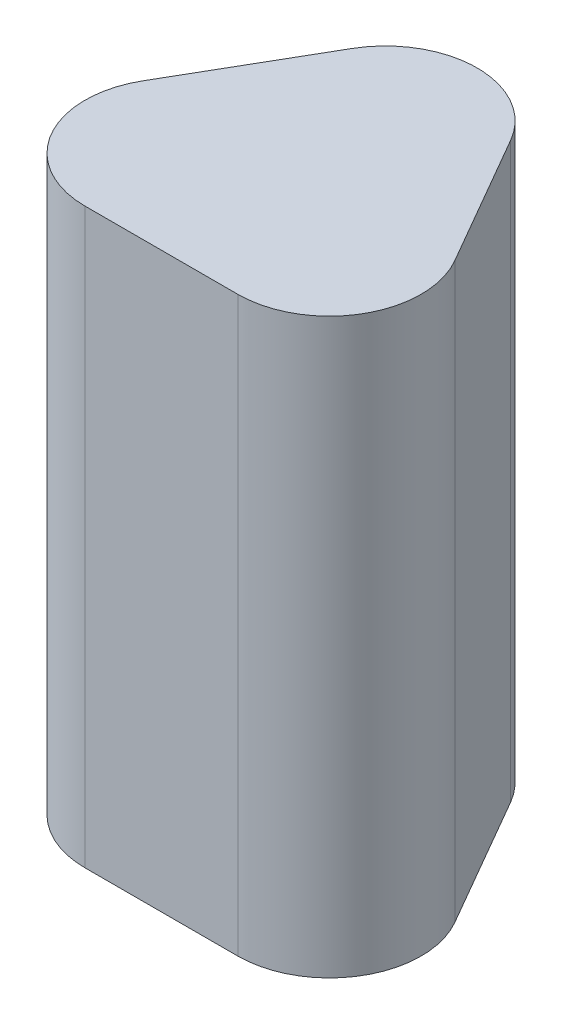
ISO-10303-21;
HEADER;
FILE_DESCRIPTION(('STEP AP214'),'2;1');
FILE_NAME('part.step','',(''),(''),'','','');
FILE_SCHEMA(('AUTOMOTIVE_DESIGN { 1 0 10303 214 1 1 1 1 }'));
ENDSEC;
DATA;
#1=APPLICATION_CONTEXT('core data for automotive mechanical design processes');
#2=APPLICATION_PROTOCOL_DEFINITION('international standard','automotive_design',2000,#1);
#3=PRODUCT_CONTEXT('',#1,'mechanical');
#4=PRODUCT('Part','Part','',(#3));
#5=PRODUCT_RELATED_PRODUCT_CATEGORY('part','',(#4));
#6=PRODUCT_DEFINITION_FORMATION('','',#4);
#7=PRODUCT_DEFINITION_CONTEXT('part definition',#1,'design');
#8=PRODUCT_DEFINITION('design','',#6,#7);
#9=PRODUCT_DEFINITION_SHAPE('','',#8);
#10=(LENGTH_UNIT() NAMED_UNIT(*) SI_UNIT(.MILLI.,.METRE.));
#11=(NAMED_UNIT(*) PLANE_ANGLE_UNIT() SI_UNIT($,.RADIAN.));
#12=(NAMED_UNIT(*) SI_UNIT($,.STERADIAN.) SOLID_ANGLE_UNIT());
#13=UNCERTAINTY_MEASURE_WITH_UNIT(LENGTH_MEASURE(1.E-05),#10,'distance_accuracy_value','');
#14=(GEOMETRIC_REPRESENTATION_CONTEXT(3) GLOBAL_UNCERTAINTY_ASSIGNED_CONTEXT((#13)) GLOBAL_UNIT_ASSIGNED_CONTEXT((#10,
#11,#12)) REPRESENTATION_CONTEXT('',''));
#15=CARTESIAN_POINT('',(0.,0.,0.));
#16=DIRECTION('',(0.,0.,1.));
#17=DIRECTION('',(1.,0.,0.));
#18=AXIS2_PLACEMENT_3D('',#15,#16,#17);
#19=CARTESIAN_POINT('',(0.,75.,-11.5470053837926));
#20=DIRECTION('',(0.,-1.,0.));
#21=DIRECTION('',(0.,0.,-1.));
#22=AXIS2_PLACEMENT_3D('',#19,#20,#21);
#23=CYLINDRICAL_SURFACE('',#22,12.);
#24=CARTESIAN_POINT('',(0.,0.,-11.5470053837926));
#25=DIRECTION('',(0.,1.,0.));
#26=DIRECTION('',(0.,0.,-1.));
#27=AXIS2_PLACEMENT_3D('',#24,#25,#26);
#28=CIRCLE('',#27,12.);
#29=CARTESIAN_POINT('',(10.3923048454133,0.,-17.5470053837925));
#30=VERTEX_POINT('',#29);
#31=CARTESIAN_POINT('',(-10.3923048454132,0.,-17.5470053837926));
#32=VERTEX_POINT('',#31);
#33=EDGE_CURVE('E257',#30,#32,#28,.T.);
#34=ORIENTED_EDGE('',*,*,#33,.T.);
#35=DIRECTION('',(0.,-1.,0.));
#36=VECTOR('',#35,1.);
#37=CARTESIAN_POINT('',(-10.3923048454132,75.,-17.5470053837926));
#38=LINE('',#37,#36);
#39=CARTESIAN_POINT('',(-10.3923048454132,75.,-17.5470053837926));
#40=VERTEX_POINT('',#39);
#41=EDGE_CURVE('E44',#40,#32,#38,.T.);
#42=ORIENTED_EDGE('',*,*,#41,.F.);
#43=CARTESIAN_POINT('',(0.,75.,-11.5470053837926));
#44=DIRECTION('',(0.,1.,0.));
#45=DIRECTION('',(0.,0.,-1.));
#46=AXIS2_PLACEMENT_3D('',#43,#44,#45);
#47=CIRCLE('',#46,12.);
#48=CARTESIAN_POINT('',(10.3923048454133,75.,-17.5470053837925));
#49=VERTEX_POINT('',#48);
#50=EDGE_CURVE('E258',#49,#40,#47,.T.);
#51=ORIENTED_EDGE('',*,*,#50,.F.);
#52=DIRECTION('',(0.,-1.,0.));
#53=VECTOR('',#52,1.);
#54=CARTESIAN_POINT('',(10.3923048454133,75.,-17.5470053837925));
#55=LINE('',#54,#53);
#56=EDGE_CURVE('E272',#49,#30,#55,.T.);
#57=ORIENTED_EDGE('',*,*,#56,.T.);
#58=EDGE_LOOP('',(#34,#42,#51,#57));
#59=FACE_BOUND('',#58,.T.);
#60=ADVANCED_FACE('F37',(#59),#23,.T.);
#61=CARTESIAN_POINT('',(-10.3923048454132,75.,-17.5470053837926));
#62=DIRECTION('',(0.866025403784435,0.,0.500000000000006));
#63=DIRECTION('',(0.500000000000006,0.,-0.866025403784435));
#64=AXIS2_PLACEMENT_3D('',#61,#62,#63);
#65=PLANE('',#64);
#66=DIRECTION('',(-0.500000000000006,0.,0.866025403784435));
#67=VECTOR('',#66,1.);
#68=CARTESIAN_POINT('',(-10.3923048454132,0.,-17.5470053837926));
#69=LINE('',#68,#67);
#70=CARTESIAN_POINT('',(-20.3923048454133,0.,-0.226497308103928));
#71=VERTEX_POINT('',#70);
#72=EDGE_CURVE('E275',#32,#71,#69,.T.);
#73=ORIENTED_EDGE('',*,*,#72,.T.);
#74=DIRECTION('',(0.,-1.,0.));
#75=VECTOR('',#74,1.);
#76=CARTESIAN_POINT('',(-20.3923048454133,75.,-0.226497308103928));
#77=LINE('',#76,#75);
#78=CARTESIAN_POINT('',(-20.3923048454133,75.,-0.226497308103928));
#79=VERTEX_POINT('',#78);
#80=EDGE_CURVE('E295',#79,#71,#77,.T.);
#81=ORIENTED_EDGE('',*,*,#80,.F.);
#82=DIRECTION('',(-0.500000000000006,0.,0.866025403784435));
#83=VECTOR('',#82,1.);
#84=CARTESIAN_POINT('',(-10.3923048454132,75.,-17.5470053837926));
#85=LINE('',#84,#83);
#86=EDGE_CURVE('E261',#40,#79,#85,.T.);
#87=ORIENTED_EDGE('',*,*,#86,.F.);
#88=ORIENTED_EDGE('',*,*,#41,.T.);
#89=EDGE_LOOP('',(#73,#81,#87,#88));
#90=FACE_BOUND('',#89,.T.);
#91=ADVANCED_FACE('F300',(#90),#65,.F.);
#92=CARTESIAN_POINT('',(-10.0000000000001,75.,5.77350269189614));
#93=DIRECTION('',(0.,-1.,0.));
#94=DIRECTION('',(0.,0.,-1.));
#95=AXIS2_PLACEMENT_3D('',#92,#93,#94);
#96=CYLINDRICAL_SURFACE('',#95,12.);
#97=CARTESIAN_POINT('',(-10.0000000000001,0.,5.77350269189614));
#98=DIRECTION('',(0.,1.,0.));
#99=DIRECTION('',(0.,0.,1.));
#100=AXIS2_PLACEMENT_3D('',#97,#98,#99);
#101=CIRCLE('',#100,12.);
#102=CARTESIAN_POINT('',(-10.0000000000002,0.,17.7735026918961));
#103=VERTEX_POINT('',#102);
#104=EDGE_CURVE('E277',#71,#103,#101,.T.);
#105=ORIENTED_EDGE('',*,*,#104,.T.);
#106=DIRECTION('',(0.,-1.,0.));
#107=VECTOR('',#106,1.);
#108=CARTESIAN_POINT('',(-10.0000000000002,75.,17.7735026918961));
#109=LINE('',#108,#107);
#110=CARTESIAN_POINT('',(-10.0000000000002,75.,17.7735026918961));
#111=VERTEX_POINT('',#110);
#112=EDGE_CURVE('E292',#111,#103,#109,.T.);
#113=ORIENTED_EDGE('',*,*,#112,.F.);
#114=CARTESIAN_POINT('',(-10.0000000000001,75.,5.77350269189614));
#115=DIRECTION('',(0.,1.,0.));
#116=DIRECTION('',(0.,0.,1.));
#117=AXIS2_PLACEMENT_3D('',#114,#115,#116);
#118=CIRCLE('',#117,12.);
#119=EDGE_CURVE('E264',#79,#111,#118,.T.);
#120=ORIENTED_EDGE('',*,*,#119,.F.);
#121=ORIENTED_EDGE('',*,*,#80,.T.);
#122=EDGE_LOOP('',(#105,#113,#120,#121));
#123=FACE_BOUND('',#122,.T.);
#124=ADVANCED_FACE('F314',(#123),#96,.T.);
#125=CARTESIAN_POINT('',(9.9999999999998,75.,17.7735026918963));
#126=DIRECTION('',(0.,0.,-1.));
#127=DIRECTION('',(-1.,0.,0.));
#128=AXIS2_PLACEMENT_3D('',#125,#126,#127);
#129=PLANE('',#128);
#130=DIRECTION('',(1.,0.,0.));
#131=VECTOR('',#130,1.);
#132=CARTESIAN_POINT('',(9.9999999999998,0.,17.7735026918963));
#133=LINE('',#132,#131);
#134=CARTESIAN_POINT('',(9.9999999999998,0.,17.7735026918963));
#135=VERTEX_POINT('',#134);
#136=EDGE_CURVE('E279',#103,#135,#133,.T.);
#137=ORIENTED_EDGE('',*,*,#136,.T.);
#138=DIRECTION('',(0.,-1.,0.));
#139=VECTOR('',#138,1.);
#140=CARTESIAN_POINT('',(9.9999999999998,75.,17.7735026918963));
#141=LINE('',#140,#139);
#142=CARTESIAN_POINT('',(9.9999999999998,75.,17.7735026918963));
#143=VERTEX_POINT('',#142);
#144=EDGE_CURVE('E289',#143,#135,#141,.T.);
#145=ORIENTED_EDGE('',*,*,#144,.F.);
#146=DIRECTION('',(1.,0.,0.));
#147=VECTOR('',#146,1.);
#148=CARTESIAN_POINT('',(9.9999999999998,75.,17.7735026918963));
#149=LINE('',#148,#147);
#150=EDGE_CURVE('E266',#111,#143,#149,.T.);
#151=ORIENTED_EDGE('',*,*,#150,.F.);
#152=ORIENTED_EDGE('',*,*,#112,.T.);
#153=EDGE_LOOP('',(#137,#145,#151,#152));
#154=FACE_BOUND('',#153,.T.);
#155=ADVANCED_FACE('F318',(#154),#129,.F.);
#156=CARTESIAN_POINT('',(9.99999999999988,75.,5.77350269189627));
#157=DIRECTION('',(0.,-1.,0.));
#158=DIRECTION('',(0.,0.,-1.));
#159=AXIS2_PLACEMENT_3D('',#156,#157,#158);
#160=CYLINDRICAL_SURFACE('',#159,12.);
#161=CARTESIAN_POINT('',(9.99999999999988,0.,5.77350269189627));
#162=DIRECTION('',(0.,1.,0.));
#163=DIRECTION('',(0.,0.,-1.));
#164=AXIS2_PLACEMENT_3D('',#161,#162,#163);
#165=CIRCLE('',#164,12.);
#166=CARTESIAN_POINT('',(20.3923048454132,0.,-0.226497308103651));
#167=VERTEX_POINT('',#166);
#168=EDGE_CURVE('E281',#135,#167,#165,.T.);
#169=ORIENTED_EDGE('',*,*,#168,.T.);
#170=DIRECTION('',(0.,-1.,0.));
#171=VECTOR('',#170,1.);
#172=CARTESIAN_POINT('',(20.3923048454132,75.,-0.226497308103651));
#173=LINE('',#172,#171);
#174=CARTESIAN_POINT('',(20.3923048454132,75.,-0.226497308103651));
#175=VERTEX_POINT('',#174);
#176=EDGE_CURVE('E286',#175,#167,#173,.T.);
#177=ORIENTED_EDGE('',*,*,#176,.F.);
#178=CARTESIAN_POINT('',(9.99999999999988,75.,5.77350269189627));
#179=DIRECTION('',(0.,1.,0.));
#180=DIRECTION('',(0.,0.,-1.));
#181=AXIS2_PLACEMENT_3D('',#178,#179,#180);
#182=CIRCLE('',#181,12.);
#183=EDGE_CURVE('E268',#143,#175,#182,.T.);
#184=ORIENTED_EDGE('',*,*,#183,.F.);
#185=ORIENTED_EDGE('',*,*,#144,.T.);
#186=EDGE_LOOP('',(#169,#177,#184,#185));
#187=FACE_BOUND('',#186,.T.);
#188=ADVANCED_FACE('F328',(#187),#160,.T.);
#189=CARTESIAN_POINT('',(10.3923048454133,75.,-17.5470053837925));
#190=DIRECTION('',(-0.866025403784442,0.,0.499999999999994));
#191=DIRECTION('',(0.499999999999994,0.,0.866025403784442));
#192=AXIS2_PLACEMENT_3D('',#189,#190,#191);
#193=PLANE('',#192);
#194=DIRECTION('',(-0.499999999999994,0.,-0.866025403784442));
#195=VECTOR('',#194,1.);
#196=CARTESIAN_POINT('',(10.3923048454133,0.,-17.5470053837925));
#197=LINE('',#196,#195);
#198=EDGE_CURVE('E262',#167,#30,#197,.T.);
#199=ORIENTED_EDGE('',*,*,#198,.T.);
#200=ORIENTED_EDGE('',*,*,#56,.F.);
#201=DIRECTION('',(-0.499999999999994,0.,-0.866025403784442));
#202=VECTOR('',#201,1.);
#203=CARTESIAN_POINT('',(10.3923048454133,75.,-17.5470053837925));
#204=LINE('',#203,#202);
#205=EDGE_CURVE('E270',#175,#49,#204,.T.);
#206=ORIENTED_EDGE('',*,*,#205,.F.);
#207=ORIENTED_EDGE('',*,*,#176,.T.);
#208=EDGE_LOOP('',(#199,#200,#206,#207));
#209=FACE_BOUND('',#208,.T.);
#210=ADVANCED_FACE('F326',(#209),#193,.F.);
#211=CARTESIAN_POINT('',(0.,75.,-11.5470053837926));
#212=DIRECTION('',(0.,-1.,0.));
#213=DIRECTION('',(0.,0.,-1.));
#214=AXIS2_PLACEMENT_3D('',#211,#212,#213);
#215=PLANE('',#214);
#216=ORIENTED_EDGE('',*,*,#50,.T.);
#217=ORIENTED_EDGE('',*,*,#86,.T.);
#218=ORIENTED_EDGE('',*,*,#119,.T.);
#219=ORIENTED_EDGE('',*,*,#150,.T.);
#220=ORIENTED_EDGE('',*,*,#183,.T.);
#221=ORIENTED_EDGE('',*,*,#205,.T.);
#222=EDGE_LOOP('',(#216,#217,#218,#219,#220,#221));
#223=FACE_BOUND('',#222,.T.);
#224=ADVANCED_FACE('F322',(#223),#215,.F.);
#225=CARTESIAN_POINT('',(0.,0.,-11.5470053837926));
#226=DIRECTION('',(0.,-1.,0.));
#227=DIRECTION('',(0.,0.,-1.));
#228=AXIS2_PLACEMENT_3D('',#225,#226,#227);
#229=PLANE('',#228);
#230=CARTESIAN_POINT('',(0.,0.,-11.5470053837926));
#231=DIRECTION('',(0.,-1.,0.));
#232=DIRECTION('',(0.,0.,-1.));
#233=AXIS2_PLACEMENT_3D('',#230,#231,#232);
#234=CIRCLE('',#233,10.75);
#235=CARTESIAN_POINT('',(-9.30977309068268,0.,-16.9220053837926));
#236=VERTEX_POINT('',#235);
#237=CARTESIAN_POINT('',(9.30977309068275,0.,-16.9220053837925));
#238=VERTEX_POINT('',#237);
#239=EDGE_CURVE('E51',#236,#238,#234,.T.);
#240=ORIENTED_EDGE('',*,*,#239,.F.);
#241=DIRECTION('',(0.500000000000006,0.,-0.866025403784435));
#242=VECTOR('',#241,1.);
#243=CARTESIAN_POINT('',(-19.3097730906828,0.,0.398502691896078));
#244=LINE('',#243,#242);
#245=CARTESIAN_POINT('',(-19.3097730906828,0.,0.398502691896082));
#246=VERTEX_POINT('',#245);
#247=EDGE_CURVE('E181',#246,#236,#244,.T.);
#248=ORIENTED_EDGE('',*,*,#247,.F.);
#249=CARTESIAN_POINT('',(-10.0000000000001,0.,5.77350269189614));
#250=DIRECTION('',(0.,-1.,0.));
#251=DIRECTION('',(0.,0.,-1.));
#252=AXIS2_PLACEMENT_3D('',#249,#250,#251);
#253=CIRCLE('',#252,10.75);
#254=CARTESIAN_POINT('',(-10.0000000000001,0.,16.5235026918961));
#255=VERTEX_POINT('',#254);
#256=EDGE_CURVE('E184',#255,#246,#253,.T.);
#257=ORIENTED_EDGE('',*,*,#256,.F.);
#258=DIRECTION('',(-1.,0.,0.));
#259=VECTOR('',#258,1.);
#260=CARTESIAN_POINT('',(9.99999999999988,0.,16.5235026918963));
#261=LINE('',#260,#259);
#262=CARTESIAN_POINT('',(9.99999999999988,0.,16.5235026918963));
#263=VERTEX_POINT('',#262);
#264=EDGE_CURVE('E204',#263,#255,#261,.T.);
#265=ORIENTED_EDGE('',*,*,#264,.F.);
#266=CARTESIAN_POINT('',(9.99999999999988,0.,5.77350269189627));
#267=DIRECTION('',(0.,-1.,0.));
#268=DIRECTION('',(0.,0.,-1.));
#269=AXIS2_PLACEMENT_3D('',#266,#267,#268);
#270=CIRCLE('',#269,10.75);
#271=CARTESIAN_POINT('',(19.3097730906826,0.,0.398502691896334));
#272=VERTEX_POINT('',#271);
#273=EDGE_CURVE('E201',#272,#263,#270,.T.);
#274=ORIENTED_EDGE('',*,*,#273,.F.);
#275=DIRECTION('',(0.499999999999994,0.,0.866025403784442));
#276=VECTOR('',#275,1.);
#277=CARTESIAN_POINT('',(9.30977309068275,0.,-16.9220053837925));
#278=LINE('',#277,#276);
#279=EDGE_CURVE('E198',#238,#272,#278,.T.);
#280=ORIENTED_EDGE('',*,*,#279,.F.);
#281=EDGE_LOOP('',(#240,#248,#257,#265,#274,#280));
#282=FACE_BOUND('',#281,.T.);
#283=ORIENTED_EDGE('',*,*,#33,.F.);
#284=ORIENTED_EDGE('',*,*,#198,.F.);
#285=ORIENTED_EDGE('',*,*,#168,.F.);
#286=ORIENTED_EDGE('',*,*,#136,.F.);
#287=ORIENTED_EDGE('',*,*,#104,.F.);
#288=ORIENTED_EDGE('',*,*,#72,.F.);
#289=EDGE_LOOP('',(#283,#284,#285,#286,#287,#288));
#290=FACE_BOUND('',#289,.T.);
#291=ADVANCED_FACE('F308',(#282,#290),#229,.T.);
#292=CARTESIAN_POINT('',(0.,2.5,-11.5470053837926));
#293=DIRECTION('',(0.,-1.,0.));
#294=DIRECTION('',(0.,0.,-1.));
#295=AXIS2_PLACEMENT_3D('',#292,#293,#294);
#296=PLANE('',#295);
#297=CARTESIAN_POINT('',(0.,2.5,-11.5470053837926));
#298=DIRECTION('',(0.,-1.,0.));
#299=DIRECTION('',(0.,0.,-1.));
#300=AXIS2_PLACEMENT_3D('',#297,#298,#299);
#301=CIRCLE('',#300,10.75);
#302=CARTESIAN_POINT('',(-9.30977309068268,2.5,-16.9220053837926));
#303=VERTEX_POINT('',#302);
#304=CARTESIAN_POINT('',(9.30977309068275,2.5,-16.9220053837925));
#305=VERTEX_POINT('',#304);
#306=EDGE_CURVE('E162',#303,#305,#301,.T.);
#307=ORIENTED_EDGE('',*,*,#306,.T.);
#308=DIRECTION('',(0.499999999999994,0.,0.866025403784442));
#309=VECTOR('',#308,1.);
#310=CARTESIAN_POINT('',(9.30977309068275,2.5,-16.9220053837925));
#311=LINE('',#310,#309);
#312=CARTESIAN_POINT('',(19.3097730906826,2.5,0.398502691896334));
#313=VERTEX_POINT('',#312);
#314=EDGE_CURVE('E171',#305,#313,#311,.T.);
#315=ORIENTED_EDGE('',*,*,#314,.T.);
#316=CARTESIAN_POINT('',(9.99999999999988,2.5,5.77350269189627));
#317=DIRECTION('',(0.,-1.,0.));
#318=DIRECTION('',(0.,0.,-1.));
#319=AXIS2_PLACEMENT_3D('',#316,#317,#318);
#320=CIRCLE('',#319,10.75);
#321=CARTESIAN_POINT('',(9.99999999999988,2.5,16.5235026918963));
#322=VERTEX_POINT('',#321);
#323=EDGE_CURVE('E176',#313,#322,#320,.T.);
#324=ORIENTED_EDGE('',*,*,#323,.T.);
#325=DIRECTION('',(-1.,0.,0.));
#326=VECTOR('',#325,1.);
#327=CARTESIAN_POINT('',(9.99999999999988,2.5,16.5235026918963));
#328=LINE('',#327,#326);
#329=CARTESIAN_POINT('',(-10.0000000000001,2.5,16.5235026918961));
#330=VERTEX_POINT('',#329);
#331=EDGE_CURVE('E191',#322,#330,#328,.T.);
#332=ORIENTED_EDGE('',*,*,#331,.T.);
#333=CARTESIAN_POINT('',(-10.0000000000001,2.5,5.77350269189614));
#334=DIRECTION('',(0.,-1.,0.));
#335=DIRECTION('',(0.,0.,-1.));
#336=AXIS2_PLACEMENT_3D('',#333,#334,#335);
#337=CIRCLE('',#336,10.75);
#338=CARTESIAN_POINT('',(-19.3097730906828,2.5,0.398502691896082));
#339=VERTEX_POINT('',#338);
#340=EDGE_CURVE('E194',#330,#339,#337,.T.);
#341=ORIENTED_EDGE('',*,*,#340,.T.);
#342=DIRECTION('',(0.500000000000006,0.,-0.866025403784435));
#343=VECTOR('',#342,1.);
#344=CARTESIAN_POINT('',(-19.3097730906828,2.5,0.398502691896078));
#345=LINE('',#344,#343);
#346=EDGE_CURVE('E168',#339,#303,#345,.T.);
#347=ORIENTED_EDGE('',*,*,#346,.T.);
#348=EDGE_LOOP('',(#307,#315,#324,#332,#341,#347));
#349=FACE_BOUND('',#348,.T.);
#350=CARTESIAN_POINT('',(-10.0000000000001,2.5,5.77350269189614));
#351=DIRECTION('',(0.,-1.,0.));
#352=DIRECTION('',(0.,0.,-1.));
#353=AXIS2_PLACEMENT_3D('',#350,#351,#352);
#354=CIRCLE('',#353,9.5);
#355=CARTESIAN_POINT('',(-18.2272413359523,2.5,1.02350269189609));
#356=VERTEX_POINT('',#355);
#357=CARTESIAN_POINT('',(-10.0000000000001,2.5,15.2735026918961));
#358=VERTEX_POINT('',#357);
#359=EDGE_CURVE('E225',#356,#358,#354,.F.);
#360=ORIENTED_EDGE('',*,*,#359,.T.);
#361=DIRECTION('',(1.,0.,0.));
#362=VECTOR('',#361,1.);
#363=CARTESIAN_POINT('',(-10.0000000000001,2.5,15.2735026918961));
#364=LINE('',#363,#362);
#365=CARTESIAN_POINT('',(9.99999999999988,2.5,15.2735026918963));
#366=VERTEX_POINT('',#365);
#367=EDGE_CURVE('E223',#358,#366,#364,.T.);
#368=ORIENTED_EDGE('',*,*,#367,.T.);
#369=CARTESIAN_POINT('',(9.99999999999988,2.5,5.77350269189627));
#370=DIRECTION('',(0.,-1.,0.));
#371=DIRECTION('',(0.,0.,-1.));
#372=AXIS2_PLACEMENT_3D('',#369,#370,#371);
#373=CIRCLE('',#372,9.5);
#374=CARTESIAN_POINT('',(18.2272413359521,2.5,1.02350269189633));
#375=VERTEX_POINT('',#374);
#376=EDGE_CURVE('E221',#366,#375,#373,.F.);
#377=ORIENTED_EDGE('',*,*,#376,.T.);
#378=DIRECTION('',(-0.499999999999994,0.,-0.866025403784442));
#379=VECTOR('',#378,1.);
#380=CARTESIAN_POINT('',(18.2272413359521,2.5,1.02350269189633));
#381=LINE('',#380,#379);
#382=CARTESIAN_POINT('',(8.2272413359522,2.5,-16.2970053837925));
#383=VERTEX_POINT('',#382);
#384=EDGE_CURVE('E219',#375,#383,#381,.T.);
#385=ORIENTED_EDGE('',*,*,#384,.T.);
#386=CARTESIAN_POINT('',(0.,2.5,-11.5470053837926));
#387=DIRECTION('',(0.,-1.,0.));
#388=DIRECTION('',(0.,0.,-1.));
#389=AXIS2_PLACEMENT_3D('',#386,#387,#388);
#390=CIRCLE('',#389,9.5);
#391=CARTESIAN_POINT('',(-8.22724133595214,2.5,-16.2970053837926));
#392=VERTEX_POINT('',#391);
#393=EDGE_CURVE('E58',#383,#392,#390,.F.);
#394=ORIENTED_EDGE('',*,*,#393,.T.);
#395=DIRECTION('',(-0.500000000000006,0.,0.866025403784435));
#396=VECTOR('',#395,1.);
#397=CARTESIAN_POINT('',(-18.2272413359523,2.5,1.02350269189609));
#398=LINE('',#397,#396);
#399=EDGE_CURVE('E12',#392,#356,#398,.T.);
#400=ORIENTED_EDGE('',*,*,#399,.T.);
#401=EDGE_LOOP('',(#360,#368,#377,#385,#394,#400));
#402=FACE_BOUND('',#401,.T.);
#403=ADVANCED_FACE('F178',(#349,#402),#296,.T.);
#404=CARTESIAN_POINT('',(0.,2.5,-11.5470053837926));
#405=DIRECTION('',(0.,-1.,0.));
#406=DIRECTION('',(0.,0.,-1.));
#407=AXIS2_PLACEMENT_3D('',#404,#405,#406);
#408=CYLINDRICAL_SURFACE('',#407,10.75);
#409=ORIENTED_EDGE('',*,*,#239,.T.);
#410=DIRECTION('',(0.,-1.,0.));
#411=VECTOR('',#410,1.);
#412=CARTESIAN_POINT('',(9.30977309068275,2.5,-16.9220053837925));
#413=LINE('',#412,#411);
#414=EDGE_CURVE('E158',#305,#238,#413,.T.);
#415=ORIENTED_EDGE('',*,*,#414,.F.);
#416=ORIENTED_EDGE('',*,*,#306,.F.);
#417=DIRECTION('',(0.,-1.,0.));
#418=VECTOR('',#417,1.);
#419=CARTESIAN_POINT('',(-9.30977309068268,2.5,-16.9220053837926));
#420=LINE('',#419,#418);
#421=EDGE_CURVE('E209',#303,#236,#420,.T.);
#422=ORIENTED_EDGE('',*,*,#421,.T.);
#423=EDGE_LOOP('',(#409,#415,#416,#422));
#424=FACE_BOUND('',#423,.T.);
#425=ADVANCED_FACE('F160',(#424),#408,.F.);
#426=CARTESIAN_POINT('',(-19.3097730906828,2.5,0.398502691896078));
#427=DIRECTION('',(-0.866025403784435,0.,-0.500000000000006));
#428=DIRECTION('',(-0.500000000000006,0.,0.866025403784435));
#429=AXIS2_PLACEMENT_3D('',#426,#427,#428);
#430=PLANE('',#429);
#431=ORIENTED_EDGE('',*,*,#247,.T.);
#432=ORIENTED_EDGE('',*,*,#421,.F.);
#433=ORIENTED_EDGE('',*,*,#346,.F.);
#434=DIRECTION('',(0.,-1.,0.));
#435=VECTOR('',#434,1.);
#436=CARTESIAN_POINT('',(-19.3097730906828,2.5,0.398502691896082));
#437=LINE('',#436,#435);
#438=EDGE_CURVE('E211',#339,#246,#437,.T.);
#439=ORIENTED_EDGE('',*,*,#438,.T.);
#440=EDGE_LOOP('',(#431,#432,#433,#439));
#441=FACE_BOUND('',#440,.T.);
#442=ADVANCED_FACE('F397',(#441),#430,.F.);
#443=CARTESIAN_POINT('',(-10.0000000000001,2.5,5.77350269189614));
#444=DIRECTION('',(0.,-1.,0.));
#445=DIRECTION('',(0.,0.,-1.));
#446=AXIS2_PLACEMENT_3D('',#443,#444,#445);
#447=CYLINDRICAL_SURFACE('',#446,10.75);
#448=ORIENTED_EDGE('',*,*,#256,.T.);
#449=ORIENTED_EDGE('',*,*,#438,.F.);
#450=ORIENTED_EDGE('',*,*,#340,.F.);
#451=DIRECTION('',(0.,-1.,0.));
#452=VECTOR('',#451,1.);
#453=CARTESIAN_POINT('',(-10.0000000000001,2.5,16.5235026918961));
#454=LINE('',#453,#452);
#455=EDGE_CURVE('E213',#330,#255,#454,.T.);
#456=ORIENTED_EDGE('',*,*,#455,.T.);
#457=EDGE_LOOP('',(#448,#449,#450,#456));
#458=FACE_BOUND('',#457,.T.);
#459=ADVANCED_FACE('F406',(#458),#447,.F.);
#460=CARTESIAN_POINT('',(9.99999999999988,2.5,16.5235026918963));
#461=DIRECTION('',(0.,0.,1.));
#462=DIRECTION('',(1.,0.,0.));
#463=AXIS2_PLACEMENT_3D('',#460,#461,#462);
#464=PLANE('',#463);
#465=ORIENTED_EDGE('',*,*,#264,.T.);
#466=ORIENTED_EDGE('',*,*,#455,.F.);
#467=ORIENTED_EDGE('',*,*,#331,.F.);
#468=DIRECTION('',(0.,-1.,0.));
#469=VECTOR('',#468,1.);
#470=CARTESIAN_POINT('',(9.99999999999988,2.5,16.5235026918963));
#471=LINE('',#470,#469);
#472=EDGE_CURVE('E215',#322,#263,#471,.T.);
#473=ORIENTED_EDGE('',*,*,#472,.T.);
#474=EDGE_LOOP('',(#465,#466,#467,#473));
#475=FACE_BOUND('',#474,.T.);
#476=ADVANCED_FACE('F416',(#475),#464,.F.);
#477=CARTESIAN_POINT('',(9.99999999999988,2.5,5.77350269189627));
#478=DIRECTION('',(0.,-1.,0.));
#479=DIRECTION('',(0.,0.,-1.));
#480=AXIS2_PLACEMENT_3D('',#477,#478,#479);
#481=CYLINDRICAL_SURFACE('',#480,10.75);
#482=ORIENTED_EDGE('',*,*,#273,.T.);
#483=ORIENTED_EDGE('',*,*,#472,.F.);
#484=ORIENTED_EDGE('',*,*,#323,.F.);
#485=DIRECTION('',(0.,-1.,0.));
#486=VECTOR('',#485,1.);
#487=CARTESIAN_POINT('',(19.3097730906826,2.5,0.398502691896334));
#488=LINE('',#487,#486);
#489=EDGE_CURVE('E167',#313,#272,#488,.T.);
#490=ORIENTED_EDGE('',*,*,#489,.T.);
#491=EDGE_LOOP('',(#482,#483,#484,#490));
#492=FACE_BOUND('',#491,.T.);
#493=ADVANCED_FACE('F426',(#492),#481,.F.);
#494=CARTESIAN_POINT('',(9.30977309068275,2.5,-16.9220053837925));
#495=DIRECTION('',(0.866025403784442,0.,-0.499999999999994));
#496=DIRECTION('',(-0.499999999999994,0.,-0.866025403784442));
#497=AXIS2_PLACEMENT_3D('',#494,#495,#496);
#498=PLANE('',#497);
#499=ORIENTED_EDGE('',*,*,#279,.T.);
#500=ORIENTED_EDGE('',*,*,#489,.F.);
#501=ORIENTED_EDGE('',*,*,#314,.F.);
#502=ORIENTED_EDGE('',*,*,#414,.T.);
#503=EDGE_LOOP('',(#499,#500,#501,#502));
#504=FACE_BOUND('',#503,.T.);
#505=ADVANCED_FACE('F172',(#504),#498,.F.);
#506=CARTESIAN_POINT('',(0.,72.,-11.5470053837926));
#507=DIRECTION('',(0.,-1.,0.));
#508=DIRECTION('',(0.,0.,-1.));
#509=AXIS2_PLACEMENT_3D('',#506,#507,#508);
#510=PLANE('',#509);
#511=CARTESIAN_POINT('',(10.3923048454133,72.,-5.99999999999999));
#512=DIRECTION('',(0.,-1.,0.));
#513=DIRECTION('',(0.,0.,-1.));
#514=AXIS2_PLACEMENT_3D('',#511,#512,#513);
#515=CIRCLE('',#514,2.6);
#516=CARTESIAN_POINT('',(10.3923048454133,72.,-8.59999999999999));
#517=VERTEX_POINT('',#516);
#518=EDGE_CURVE('E582',#517,#517,#515,.T.);
#519=ORIENTED_EDGE('',*,*,#518,.F.);
#520=EDGE_LOOP('',(#519));
#521=FACE_BOUND('',#520,.T.);
#522=CARTESIAN_POINT('',(-10.3923048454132,72.,-6.00000000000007));
#523=DIRECTION('',(0.,-1.,0.));
#524=DIRECTION('',(0.,0.,-1.));
#525=AXIS2_PLACEMENT_3D('',#522,#523,#524);
#526=CIRCLE('',#525,2.6);
#527=CARTESIAN_POINT('',(-10.3923048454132,72.,-8.60000000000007));
#528=VERTEX_POINT('',#527);
#529=EDGE_CURVE('E581',#528,#528,#526,.T.);
#530=ORIENTED_EDGE('',*,*,#529,.F.);
#531=EDGE_LOOP('',(#530));
#532=FACE_BOUND('',#531,.T.);
#533=CARTESIAN_POINT('',(0.,72.,12.));
#534=DIRECTION('',(0.,-1.,0.));
#535=DIRECTION('',(0.,0.,-1.));
#536=AXIS2_PLACEMENT_3D('',#533,#534,#535);
#537=CIRCLE('',#536,2.6);
#538=CARTESIAN_POINT('',(0.,72.,9.4));
#539=VERTEX_POINT('',#538);
#540=EDGE_CURVE('E187',#539,#539,#537,.T.);
#541=ORIENTED_EDGE('',*,*,#540,.F.);
#542=EDGE_LOOP('',(#541));
#543=FACE_BOUND('',#542,.T.);
#544=CARTESIAN_POINT('',(-10.0000000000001,72.,5.77350269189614));
#545=DIRECTION('',(0.,-1.,0.));
#546=DIRECTION('',(0.,0.,-1.));
#547=AXIS2_PLACEMENT_3D('',#544,#545,#546);
#548=CIRCLE('',#547,9.5);
#549=CARTESIAN_POINT('',(-18.2272413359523,72.,1.02350269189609));
#550=VERTEX_POINT('',#549);
#551=CARTESIAN_POINT('',(-10.0000000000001,72.,15.2735026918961));
#552=VERTEX_POINT('',#551);
#553=EDGE_CURVE('E237',#550,#552,#548,.F.);
#554=ORIENTED_EDGE('',*,*,#553,.F.);
#555=DIRECTION('',(-0.500000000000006,0.,0.866025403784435));
#556=VECTOR('',#555,1.);
#557=CARTESIAN_POINT('',(-18.2272413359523,72.,1.02350269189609));
#558=LINE('',#557,#556);
#559=CARTESIAN_POINT('',(-8.22724133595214,72.,-16.2970053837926));
#560=VERTEX_POINT('',#559);
#561=EDGE_CURVE('E239',#560,#550,#558,.T.);
#562=ORIENTED_EDGE('',*,*,#561,.F.);
#563=CARTESIAN_POINT('',(0.,72.,-11.5470053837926));
#564=DIRECTION('',(0.,-1.,0.));
#565=DIRECTION('',(0.,0.,-1.));
#566=AXIS2_PLACEMENT_3D('',#563,#564,#565);
#567=CIRCLE('',#566,9.5);
#568=CARTESIAN_POINT('',(8.2272413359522,72.,-16.2970053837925));
#569=VERTEX_POINT('',#568);
#570=EDGE_CURVE('E228',#569,#560,#567,.F.);
#571=ORIENTED_EDGE('',*,*,#570,.F.);
#572=DIRECTION('',(-0.499999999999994,0.,-0.866025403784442));
#573=VECTOR('',#572,1.);
#574=CARTESIAN_POINT('',(18.2272413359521,72.,1.02350269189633));
#575=LINE('',#574,#573);
#576=CARTESIAN_POINT('',(18.2272413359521,72.,1.02350269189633));
#577=VERTEX_POINT('',#576);
#578=EDGE_CURVE('E230',#577,#569,#575,.T.);
#579=ORIENTED_EDGE('',*,*,#578,.F.);
#580=CARTESIAN_POINT('',(9.99999999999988,72.,5.77350269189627));
#581=DIRECTION('',(0.,-1.,0.));
#582=DIRECTION('',(0.,0.,-1.));
#583=AXIS2_PLACEMENT_3D('',#580,#581,#582);
#584=CIRCLE('',#583,9.5);
#585=CARTESIAN_POINT('',(9.99999999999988,72.,15.2735026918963));
#586=VERTEX_POINT('',#585);
#587=EDGE_CURVE('E233',#586,#577,#584,.F.);
#588=ORIENTED_EDGE('',*,*,#587,.F.);
#589=DIRECTION('',(1.,0.,0.));
#590=VECTOR('',#589,1.);
#591=CARTESIAN_POINT('',(-10.0000000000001,72.,15.2735026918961));
#592=LINE('',#591,#590);
#593=EDGE_CURVE('E235',#552,#586,#592,.T.);
#594=ORIENTED_EDGE('',*,*,#593,.F.);
#595=EDGE_LOOP('',(#554,#562,#571,#579,#588,#594));
#596=FACE_BOUND('',#595,.T.);
#597=ADVANCED_FACE('F445',(#521,#532,#543,#596),#510,.T.);
#598=CARTESIAN_POINT('',(-18.2272413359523,128.293332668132,1.02350269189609));
#599=DIRECTION('',(-0.866025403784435,0.,-0.500000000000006));
#600=DIRECTION('',(-0.500000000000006,0.,0.866025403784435));
#601=AXIS2_PLACEMENT_3D('',#598,#599,#600);
#602=PLANE('',#601);
#603=ORIENTED_EDGE('',*,*,#399,.F.);
#604=DIRECTION('',(0.,-1.,0.));
#605=VECTOR('',#604,1.);
#606=CARTESIAN_POINT('',(-8.22724133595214,128.293332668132,-16.2970053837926));
#607=LINE('',#606,#605);
#608=EDGE_CURVE('E251',#560,#392,#607,.T.);
#609=ORIENTED_EDGE('',*,*,#608,.F.);
#610=ORIENTED_EDGE('',*,*,#561,.T.);
#611=DIRECTION('',(0.,-1.,0.));
#612=VECTOR('',#611,1.);
#613=CARTESIAN_POINT('',(-18.2272413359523,128.293332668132,1.02350269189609));
#614=LINE('',#613,#612);
#615=EDGE_CURVE('E227',#550,#356,#614,.T.);
#616=ORIENTED_EDGE('',*,*,#615,.T.);
#617=EDGE_LOOP('',(#603,#609,#610,#616));
#618=FACE_BOUND('',#617,.T.);
#619=ADVANCED_FACE('F452',(#618),#602,.F.);
#620=CARTESIAN_POINT('',(0.,128.293332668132,-11.5470053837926));
#621=DIRECTION('',(0.,-1.,0.));
#622=DIRECTION('',(0.,0.,-1.));
#623=AXIS2_PLACEMENT_3D('',#620,#621,#622);
#624=CYLINDRICAL_SURFACE('',#623,9.5);
#625=ORIENTED_EDGE('',*,*,#393,.F.);
#626=DIRECTION('',(0.,-1.,0.));
#627=VECTOR('',#626,1.);
#628=CARTESIAN_POINT('',(8.2272413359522,128.293332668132,-16.2970053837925));
#629=LINE('',#628,#627);
#630=EDGE_CURVE('E248',#569,#383,#629,.T.);
#631=ORIENTED_EDGE('',*,*,#630,.F.);
#632=ORIENTED_EDGE('',*,*,#570,.T.);
#633=ORIENTED_EDGE('',*,*,#608,.T.);
#634=EDGE_LOOP('',(#625,#631,#632,#633));
#635=FACE_BOUND('',#634,.T.);
#636=ADVANCED_FACE('F457',(#635),#624,.F.);
#637=CARTESIAN_POINT('',(18.2272413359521,128.293332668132,1.02350269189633));
#638=DIRECTION('',(0.866025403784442,0.,-0.499999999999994));
#639=DIRECTION('',(-0.499999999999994,0.,-0.866025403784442));
#640=AXIS2_PLACEMENT_3D('',#637,#638,#639);
#641=PLANE('',#640);
#642=ORIENTED_EDGE('',*,*,#384,.F.);
#643=DIRECTION('',(0.,-1.,0.));
#644=VECTOR('',#643,1.);
#645=CARTESIAN_POINT('',(18.2272413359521,128.293332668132,1.02350269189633));
#646=LINE('',#645,#644);
#647=EDGE_CURVE('E245',#577,#375,#646,.T.);
#648=ORIENTED_EDGE('',*,*,#647,.F.);
#649=ORIENTED_EDGE('',*,*,#578,.T.);
#650=ORIENTED_EDGE('',*,*,#630,.T.);
#651=EDGE_LOOP('',(#642,#648,#649,#650));
#652=FACE_BOUND('',#651,.T.);
#653=ADVANCED_FACE('F468',(#652),#641,.F.);
#654=CARTESIAN_POINT('',(9.99999999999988,128.293332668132,5.77350269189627));
#655=DIRECTION('',(0.,-1.,0.));
#656=DIRECTION('',(0.,0.,-1.));
#657=AXIS2_PLACEMENT_3D('',#654,#655,#656);
#658=CYLINDRICAL_SURFACE('',#657,9.5);
#659=ORIENTED_EDGE('',*,*,#376,.F.);
#660=DIRECTION('',(0.,-1.,0.));
#661=VECTOR('',#660,1.);
#662=CARTESIAN_POINT('',(9.99999999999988,128.293332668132,15.2735026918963));
#663=LINE('',#662,#661);
#664=EDGE_CURVE('E242',#586,#366,#663,.T.);
#665=ORIENTED_EDGE('',*,*,#664,.F.);
#666=ORIENTED_EDGE('',*,*,#587,.T.);
#667=ORIENTED_EDGE('',*,*,#647,.T.);
#668=EDGE_LOOP('',(#659,#665,#666,#667));
#669=FACE_BOUND('',#668,.T.);
#670=ADVANCED_FACE('F478',(#669),#658,.F.);
#671=CARTESIAN_POINT('',(-10.0000000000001,128.293332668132,15.2735026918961));
#672=DIRECTION('',(0.,0.,1.));
#673=DIRECTION('',(1.,0.,0.));
#674=AXIS2_PLACEMENT_3D('',#671,#672,#673);
#675=PLANE('',#674);
#676=ORIENTED_EDGE('',*,*,#367,.F.);
#677=DIRECTION('',(0.,-1.,0.));
#678=VECTOR('',#677,1.);
#679=CARTESIAN_POINT('',(-10.0000000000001,128.293332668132,15.2735026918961));
#680=LINE('',#679,#678);
#681=EDGE_CURVE('E231',#552,#358,#680,.T.);
#682=ORIENTED_EDGE('',*,*,#681,.F.);
#683=ORIENTED_EDGE('',*,*,#593,.T.);
#684=ORIENTED_EDGE('',*,*,#664,.T.);
#685=EDGE_LOOP('',(#676,#682,#683,#684));
#686=FACE_BOUND('',#685,.T.);
#687=ADVANCED_FACE('F488',(#686),#675,.F.);
#688=CARTESIAN_POINT('',(-10.0000000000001,128.293332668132,5.77350269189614));
#689=DIRECTION('',(0.,-1.,0.));
#690=DIRECTION('',(0.,0.,-1.));
#691=AXIS2_PLACEMENT_3D('',#688,#689,#690);
#692=CYLINDRICAL_SURFACE('',#691,9.5);
#693=ORIENTED_EDGE('',*,*,#359,.F.);
#694=ORIENTED_EDGE('',*,*,#615,.F.);
#695=ORIENTED_EDGE('',*,*,#553,.T.);
#696=ORIENTED_EDGE('',*,*,#681,.T.);
#697=EDGE_LOOP('',(#693,#694,#695,#696));
#698=FACE_BOUND('',#697,.T.);
#699=ADVANCED_FACE('F498',(#698),#692,.F.);
#700=CARTESIAN_POINT('',(0.,74.,12.));
#701=DIRECTION('',(0.,-1.,0.));
#702=DIRECTION('',(0.,0.,-1.));
#703=AXIS2_PLACEMENT_3D('',#700,#701,#702);
#704=CYLINDRICAL_SURFACE('',#703,2.6);
#705=CARTESIAN_POINT('',(0.,74.,12.));
#706=DIRECTION('',(0.,-1.,0.));
#707=DIRECTION('',(0.,0.,-1.));
#708=AXIS2_PLACEMENT_3D('',#705,#706,#707);
#709=CIRCLE('',#708,2.6);
#710=CARTESIAN_POINT('',(0.,74.,9.4));
#711=VERTEX_POINT('',#710);
#712=EDGE_CURVE('E199',#711,#711,#709,.T.);
#713=ORIENTED_EDGE('',*,*,#712,.F.);
#714=EDGE_LOOP('',(#713));
#715=FACE_BOUND('',#714,.T.);
#716=ORIENTED_EDGE('',*,*,#540,.T.);
#717=EDGE_LOOP('',(#716));
#718=FACE_BOUND('',#717,.T.);
#719=ADVANCED_FACE('F507',(#715,#718),#704,.F.);
#720=CARTESIAN_POINT('',(0.,74.,12.));
#721=DIRECTION('',(0.,-1.,0.));
#722=DIRECTION('',(0.,0.,-1.));
#723=AXIS2_PLACEMENT_3D('',#720,#721,#722);
#724=PLANE('',#723);
#725=ORIENTED_EDGE('',*,*,#712,.T.);
#726=EDGE_LOOP('',(#725));
#727=FACE_BOUND('',#726,.T.);
#728=ADVANCED_FACE('F524',(#727),#724,.T.);
#729=CARTESIAN_POINT('',(-10.3923048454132,74.,-6.00000000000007));
#730=DIRECTION('',(0.,-1.,0.));
#731=DIRECTION('',(0.,0.,-1.));
#732=AXIS2_PLACEMENT_3D('',#729,#730,#731);
#733=CYLINDRICAL_SURFACE('',#732,2.6);
#734=CARTESIAN_POINT('',(-10.3923048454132,74.,-6.00000000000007));
#735=DIRECTION('',(0.,-1.,0.));
#736=DIRECTION('',(0.,0.,-1.));
#737=AXIS2_PLACEMENT_3D('',#734,#735,#736);
#738=CIRCLE('',#737,2.6);
#739=CARTESIAN_POINT('',(-10.3923048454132,74.,-8.60000000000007));
#740=VERTEX_POINT('',#739);
#741=EDGE_CURVE('E585',#740,#740,#738,.T.);
#742=ORIENTED_EDGE('',*,*,#741,.F.);
#743=EDGE_LOOP('',(#742));
#744=FACE_BOUND('',#743,.T.);
#745=ORIENTED_EDGE('',*,*,#529,.T.);
#746=EDGE_LOOP('',(#745));
#747=FACE_BOUND('',#746,.T.);
#748=ADVANCED_FACE('F534',(#744,#747),#733,.F.);
#749=CARTESIAN_POINT('',(-10.3923048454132,74.,-6.00000000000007));
#750=DIRECTION('',(0.,-1.,0.));
#751=DIRECTION('',(0.,0.,-1.));
#752=AXIS2_PLACEMENT_3D('',#749,#750,#751);
#753=PLANE('',#752);
#754=ORIENTED_EDGE('',*,*,#741,.T.);
#755=EDGE_LOOP('',(#754));
#756=FACE_BOUND('',#755,.T.);
#757=ADVANCED_FACE('F544',(#756),#753,.T.);
#758=CARTESIAN_POINT('',(10.3923048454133,74.,-5.99999999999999));
#759=DIRECTION('',(0.,-1.,0.));
#760=DIRECTION('',(0.,0.,-1.));
#761=AXIS2_PLACEMENT_3D('',#758,#759,#760);
#762=CYLINDRICAL_SURFACE('',#761,2.6);
#763=CARTESIAN_POINT('',(10.3923048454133,74.,-5.99999999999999));
#764=DIRECTION('',(0.,-1.,0.));
#765=DIRECTION('',(0.,0.,-1.));
#766=AXIS2_PLACEMENT_3D('',#763,#764,#765);
#767=CIRCLE('',#766,2.6);
#768=CARTESIAN_POINT('',(10.3923048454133,74.,-8.59999999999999));
#769=VERTEX_POINT('',#768);
#770=EDGE_CURVE('E580',#769,#769,#767,.T.);
#771=ORIENTED_EDGE('',*,*,#770,.F.);
#772=EDGE_LOOP('',(#771));
#773=FACE_BOUND('',#772,.T.);
#774=ORIENTED_EDGE('',*,*,#518,.T.);
#775=EDGE_LOOP('',(#774));
#776=FACE_BOUND('',#775,.T.);
#777=ADVANCED_FACE('F554',(#773,#776),#762,.F.);
#778=CARTESIAN_POINT('',(10.3923048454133,74.,-5.99999999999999));
#779=DIRECTION('',(0.,-1.,0.));
#780=DIRECTION('',(0.,0.,-1.));
#781=AXIS2_PLACEMENT_3D('',#778,#779,#780);
#782=PLANE('',#781);
#783=ORIENTED_EDGE('',*,*,#770,.T.);
#784=EDGE_LOOP('',(#783));
#785=FACE_BOUND('',#784,.T.);
#786=ADVANCED_FACE('F564',(#785),#782,.T.);
#787=CLOSED_SHELL('',(#60,#91,#124,#155,#188,#210,#224,#291,#403,#425,#442,#459,#476,#493,#505,
#597,#619,#636,#653,#670,#687,#699,#719,#728,#748,#757,#777,#786));
#788=MANIFOLD_SOLID_BREP('B2',#787);
#789=ADVANCED_BREP_SHAPE_REPRESENTATION('',(#18,#788),#14);
#790=SHAPE_DEFINITION_REPRESENTATION(#9,#789);
ENDSEC;
END-ISO-10303-21;
